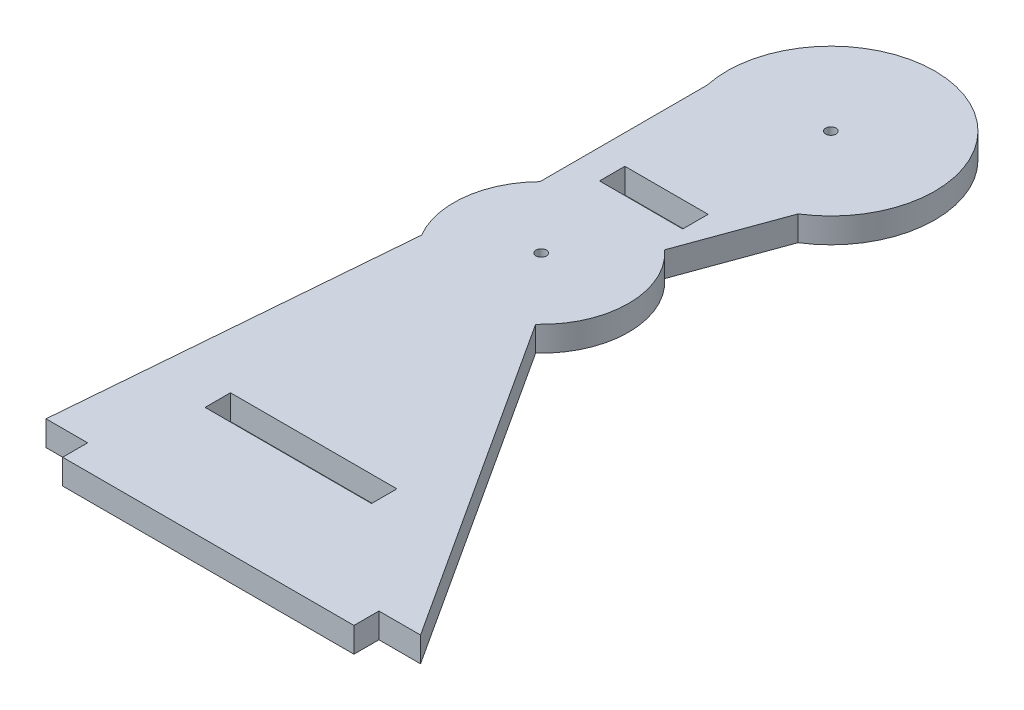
ISO-10303-21;
HEADER;
FILE_DESCRIPTION(('STEP AP214'),'2;1');
FILE_NAME('part.step','',(''),(''),'','','');
FILE_SCHEMA(('AUTOMOTIVE_DESIGN { 1 0 10303 214 1 1 1 1 }'));
ENDSEC;
DATA;
#1=APPLICATION_CONTEXT('core data for automotive mechanical design processes');
#2=APPLICATION_PROTOCOL_DEFINITION('international standard','automotive_design',2000,#1);
#3=PRODUCT_CONTEXT('',#1,'mechanical');
#4=PRODUCT('Part','Part','',(#3));
#5=PRODUCT_RELATED_PRODUCT_CATEGORY('part','',(#4));
#6=PRODUCT_DEFINITION_FORMATION('','',#4);
#7=PRODUCT_DEFINITION_CONTEXT('part definition',#1,'design');
#8=PRODUCT_DEFINITION('design','',#6,#7);
#9=PRODUCT_DEFINITION_SHAPE('','',#8);
#10=(LENGTH_UNIT() NAMED_UNIT(*) SI_UNIT(.MILLI.,.METRE.));
#11=(NAMED_UNIT(*) PLANE_ANGLE_UNIT() SI_UNIT($,.RADIAN.));
#12=(NAMED_UNIT(*) SI_UNIT($,.STERADIAN.) SOLID_ANGLE_UNIT());
#13=UNCERTAINTY_MEASURE_WITH_UNIT(LENGTH_MEASURE(1.E-05),#10,'distance_accuracy_value','');
#14=(GEOMETRIC_REPRESENTATION_CONTEXT(3) GLOBAL_UNCERTAINTY_ASSIGNED_CONTEXT((#13)) GLOBAL_UNIT_ASSIGNED_CONTEXT((#10,
#11,#12)) REPRESENTATION_CONTEXT('',''));
#15=CARTESIAN_POINT('',(0.,0.,0.));
#16=DIRECTION('',(0.,0.,1.));
#17=DIRECTION('',(1.,0.,0.));
#18=AXIS2_PLACEMENT_3D('',#15,#16,#17);
#19=CARTESIAN_POINT('',(-55.,6.,-100.));
#20=DIRECTION('',(0.,1.,0.));
#21=DIRECTION('',(0.,0.,1.));
#22=AXIS2_PLACEMENT_3D('',#19,#20,#21);
#23=PLANE('',#22);
#24=DIRECTION('',(1.,0.,0.));
#25=VECTOR('',#24,1.);
#26=CARTESIAN_POINT('',(-63.2592592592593,6.,-27.4814814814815));
#27=LINE('',#26,#25);
#28=CARTESIAN_POINT('',(-63.2592592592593,6.,-27.4814814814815));
#29=VERTEX_POINT('',#28);
#30=CARTESIAN_POINT('',(-23.2592592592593,6.,-27.4814814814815));
#31=VERTEX_POINT('',#30);
#32=EDGE_CURVE('E242',#29,#31,#27,.T.);
#33=ORIENTED_EDGE('',*,*,#32,.F.);
#34=DIRECTION('',(0.,0.,1.));
#35=VECTOR('',#34,1.);
#36=CARTESIAN_POINT('',(-63.2592592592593,6.,-33.5814814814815));
#37=LINE('',#36,#35);
#38=CARTESIAN_POINT('',(-63.2592592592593,6.,-33.5814814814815));
#39=VERTEX_POINT('',#38);
#40=EDGE_CURVE('E239',#39,#29,#37,.T.);
#41=ORIENTED_EDGE('',*,*,#40,.F.);
#42=DIRECTION('',(-1.,0.,0.));
#43=VECTOR('',#42,1.);
#44=CARTESIAN_POINT('',(-63.2592592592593,6.,-33.5814814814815));
#45=LINE('',#44,#43);
#46=CARTESIAN_POINT('',(-23.2592592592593,6.,-33.5814814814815));
#47=VERTEX_POINT('',#46);
#48=EDGE_CURVE('E250',#47,#39,#45,.T.);
#49=ORIENTED_EDGE('',*,*,#48,.F.);
#50=DIRECTION('',(0.,0.,-1.));
#51=VECTOR('',#50,1.);
#52=CARTESIAN_POINT('',(-23.2592592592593,6.,-33.5814814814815));
#53=LINE('',#52,#51);
#54=EDGE_CURVE('E246',#31,#47,#53,.T.);
#55=ORIENTED_EDGE('',*,*,#54,.F.);
#56=EDGE_LOOP('',(#33,#41,#49,#55));
#57=FACE_BOUND('',#56,.T.);
#58=CARTESIAN_POINT('',(-55.,6.,-100.));
#59=DIRECTION('',(0.,1.,0.));
#60=DIRECTION('',(0.,0.,1.));
#61=AXIS2_PLACEMENT_3D('',#58,#59,#60);
#62=CIRCLE('',#61,1.25);
#63=CARTESIAN_POINT('',(-55.,6.,-98.75));
#64=VERTEX_POINT('',#63);
#65=EDGE_CURVE('E282',#64,#64,#62,.T.);
#66=ORIENTED_EDGE('',*,*,#65,.F.);
#67=EDGE_LOOP('',(#66));
#68=FACE_BOUND('',#67,.T.);
#69=DIRECTION('',(1.,0.,0.));
#70=VECTOR('',#69,1.);
#71=CARTESIAN_POINT('',(-70.,6.,0.));
#72=LINE('',#71,#70);
#73=CARTESIAN_POINT('',(-70.,6.,0.));
#74=VERTEX_POINT('',#73);
#75=CARTESIAN_POINT('',(0.,6.,0.));
#76=VERTEX_POINT('',#75);
#77=EDGE_CURVE('E290',#74,#76,#72,.T.);
#78=ORIENTED_EDGE('',*,*,#77,.T.);
#79=DIRECTION('',(0.,0.,-1.));
#80=VECTOR('',#79,1.);
#81=CARTESIAN_POINT('',(0.,6.,0.));
#82=LINE('',#81,#80);
#83=CARTESIAN_POINT('',(0.,6.,-6.));
#84=VERTEX_POINT('',#83);
#85=EDGE_CURVE('E294',#76,#84,#82,.T.);
#86=ORIENTED_EDGE('',*,*,#85,.T.);
#87=DIRECTION('',(1.,0.,0.));
#88=VECTOR('',#87,1.);
#89=CARTESIAN_POINT('',(0.,6.,-6.));
#90=LINE('',#89,#88);
#91=CARTESIAN_POINT('',(10.,6.,-6.));
#92=VERTEX_POINT('',#91);
#93=EDGE_CURVE('E298',#84,#92,#90,.T.);
#94=ORIENTED_EDGE('',*,*,#93,.T.);
#95=DIRECTION('',(-0.543576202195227,0.,-0.83935982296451));
#96=VECTOR('',#95,1.);
#97=CARTESIAN_POINT('',(10.,6.,-6.));
#98=LINE('',#97,#96);
#99=CARTESIAN_POINT('',(-40.8350548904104,6.,-84.4966348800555));
#100=VERTEX_POINT('',#99);
#101=EDGE_CURVE('E301',#92,#100,#98,.T.);
#102=ORIENTED_EDGE('',*,*,#101,.T.);
#103=CARTESIAN_POINT('',(-55.,6.,-100.));
#104=DIRECTION('',(0.,1.,0.));
#105=DIRECTION('',(0.,0.,1.));
#106=AXIS2_PLACEMENT_3D('',#103,#104,#105);
#107=CIRCLE('',#106,21.);
#108=CARTESIAN_POINT('',(-40.8350548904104,6.,-115.503365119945));
#109=VERTEX_POINT('',#108);
#110=EDGE_CURVE('E304',#100,#109,#107,.T.);
#111=ORIENTED_EDGE('',*,*,#110,.T.);
#112=DIRECTION('',(0.342020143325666,0.,-0.93969262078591));
#113=VECTOR('',#112,1.);
#114=CARTESIAN_POINT('',(-40.8350548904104,6.,-115.503365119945));
#115=LINE('',#114,#113);
#116=CARTESIAN_POINT('',(-32.2845513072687,6.,-138.995680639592));
#117=VERTEX_POINT('',#116);
#118=EDGE_CURVE('E307',#109,#117,#115,.T.);
#119=ORIENTED_EDGE('',*,*,#118,.T.);
#120=CARTESIAN_POINT('',(-45.5718158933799,6.,-160.172285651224));
#121=DIRECTION('',(0.,1.,0.));
#122=DIRECTION('',(0.,0.,1.));
#123=AXIS2_PLACEMENT_3D('',#120,#121,#122);
#124=CIRCLE('',#123,25.);
#125=CARTESIAN_POINT('',(-70.,6.,-154.855912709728));
#126=VERTEX_POINT('',#125);
#127=EDGE_CURVE('E310',#117,#126,#124,.T.);
#128=ORIENTED_EDGE('',*,*,#127,.T.);
#129=DIRECTION('',(0.,0.,1.));
#130=VECTOR('',#129,1.);
#131=CARTESIAN_POINT('',(-70.,6.,-114.696938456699));
#132=LINE('',#131,#130);
#133=CARTESIAN_POINT('',(-70.,6.,-114.696938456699));
#134=VERTEX_POINT('',#133);
#135=EDGE_CURVE('E313',#126,#134,#132,.T.);
#136=ORIENTED_EDGE('',*,*,#135,.T.);
#137=CARTESIAN_POINT('',(-55.,6.,-100.));
#138=DIRECTION('',(0.,1.,0.));
#139=DIRECTION('',(0.,0.,1.));
#140=AXIS2_PLACEMENT_3D('',#137,#138,#139);
#141=CIRCLE('',#140,21.);
#142=CARTESIAN_POINT('',(-73.1006185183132,6.,-89.3525773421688));
#143=VERTEX_POINT('',#142);
#144=EDGE_CURVE('E316',#134,#143,#141,.T.);
#145=ORIENTED_EDGE('',*,*,#144,.T.);
#146=DIRECTION('',(-0.0824913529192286,0.,0.996591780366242));
#147=VECTOR('',#146,1.);
#148=CARTESIAN_POINT('',(-80.,6.,-6.));
#149=LINE('',#148,#147);
#150=CARTESIAN_POINT('',(-80.,6.,-6.));
#151=VERTEX_POINT('',#150);
#152=EDGE_CURVE('E319',#143,#151,#149,.T.);
#153=ORIENTED_EDGE('',*,*,#152,.T.);
#154=DIRECTION('',(1.,0.,0.));
#155=VECTOR('',#154,1.);
#156=CARTESIAN_POINT('',(-70.,6.,-6.));
#157=LINE('',#156,#155);
#158=CARTESIAN_POINT('',(-70.,6.,-6.));
#159=VERTEX_POINT('',#158);
#160=EDGE_CURVE('E322',#151,#159,#157,.T.);
#161=ORIENTED_EDGE('',*,*,#160,.T.);
#162=DIRECTION('',(0.,0.,1.));
#163=VECTOR('',#162,1.);
#164=CARTESIAN_POINT('',(-70.,6.,0.));
#165=LINE('',#164,#163);
#166=EDGE_CURVE('E325',#159,#74,#165,.T.);
#167=ORIENTED_EDGE('',*,*,#166,.T.);
#168=EDGE_LOOP('',(#78,#86,#94,#102,#111,#119,#128,#136,#145,#153,#161,#167));
#169=FACE_BOUND('',#168,.T.);
#170=CARTESIAN_POINT('',(-45.5718158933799,6.,-160.172285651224));
#171=DIRECTION('',(0.,1.,0.));
#172=DIRECTION('',(0.,0.,1.));
#173=AXIS2_PLACEMENT_3D('',#170,#171,#172);
#174=CIRCLE('',#173,1.25);
#175=CARTESIAN_POINT('',(-45.5718158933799,6.,-158.922285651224));
#176=VERTEX_POINT('',#175);
#177=EDGE_CURVE('E231',#176,#176,#174,.T.);
#178=ORIENTED_EDGE('',*,*,#177,.F.);
#179=EDGE_LOOP('',(#178));
#180=FACE_BOUND('',#179,.T.);
#181=DIRECTION('',(-1.,0.,0.));
#182=VECTOR('',#181,1.);
#183=CARTESIAN_POINT('',(-63.,6.,-128.1));
#184=LINE('',#183,#182);
#185=CARTESIAN_POINT('',(-43.,6.,-128.1));
#186=VERTEX_POINT('',#185);
#187=CARTESIAN_POINT('',(-63.,6.,-128.1));
#188=VERTEX_POINT('',#187);
#189=EDGE_CURVE('E192',#186,#188,#184,.T.);
#190=ORIENTED_EDGE('',*,*,#189,.F.);
#191=DIRECTION('',(0.,0.,-1.));
#192=VECTOR('',#191,1.);
#193=CARTESIAN_POINT('',(-43.,6.,-128.1));
#194=LINE('',#193,#192);
#195=CARTESIAN_POINT('',(-43.,6.,-122.));
#196=VERTEX_POINT('',#195);
#197=EDGE_CURVE('E183',#196,#186,#194,.T.);
#198=ORIENTED_EDGE('',*,*,#197,.F.);
#199=DIRECTION('',(1.,0.,0.));
#200=VECTOR('',#199,1.);
#201=CARTESIAN_POINT('',(-63.,6.,-122.));
#202=LINE('',#201,#200);
#203=CARTESIAN_POINT('',(-63.,6.,-122.));
#204=VERTEX_POINT('',#203);
#205=EDGE_CURVE('E209',#204,#196,#202,.T.);
#206=ORIENTED_EDGE('',*,*,#205,.F.);
#207=DIRECTION('',(0.,0.,1.));
#208=VECTOR('',#207,1.);
#209=CARTESIAN_POINT('',(-63.,6.,-128.1));
#210=LINE('',#209,#208);
#211=EDGE_CURVE('E205',#188,#204,#210,.T.);
#212=ORIENTED_EDGE('',*,*,#211,.F.);
#213=EDGE_LOOP('',(#190,#198,#206,#212));
#214=FACE_BOUND('',#213,.T.);
#215=ADVANCED_FACE('F45',(#57,#68,#169,#180,#214),#23,.T.);
#216=CARTESIAN_POINT('',(-55.,0.,-100.));
#217=DIRECTION('',(0.,1.,0.));
#218=DIRECTION('',(0.,0.,1.));
#219=AXIS2_PLACEMENT_3D('',#216,#217,#218);
#220=PLANE('',#219);
#221=CARTESIAN_POINT('',(-45.5718158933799,0.,-160.172285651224));
#222=DIRECTION('',(0.,1.,0.));
#223=DIRECTION('',(0.,0.,1.));
#224=AXIS2_PLACEMENT_3D('',#221,#222,#223);
#225=CIRCLE('',#224,1.25);
#226=CARTESIAN_POINT('',(-45.5718158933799,0.,-158.922285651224));
#227=VERTEX_POINT('',#226);
#228=EDGE_CURVE('E201',#227,#227,#225,.T.);
#229=ORIENTED_EDGE('',*,*,#228,.T.);
#230=EDGE_LOOP('',(#229));
#231=FACE_BOUND('',#230,.T.);
#232=DIRECTION('',(0.,0.,1.));
#233=VECTOR('',#232,1.);
#234=CARTESIAN_POINT('',(-63.2592592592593,0.,-33.5814814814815));
#235=LINE('',#234,#233);
#236=CARTESIAN_POINT('',(-63.2592592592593,0.,-33.5814814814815));
#237=VERTEX_POINT('',#236);
#238=CARTESIAN_POINT('',(-63.2592592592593,0.,-27.4814814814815));
#239=VERTEX_POINT('',#238);
#240=EDGE_CURVE('E235',#237,#239,#235,.T.);
#241=ORIENTED_EDGE('',*,*,#240,.T.);
#242=DIRECTION('',(1.,0.,0.));
#243=VECTOR('',#242,1.);
#244=CARTESIAN_POINT('',(-63.2592592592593,0.,-27.4814814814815));
#245=LINE('',#244,#243);
#246=CARTESIAN_POINT('',(-23.2592592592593,0.,-27.4814814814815));
#247=VERTEX_POINT('',#246);
#248=EDGE_CURVE('E257',#239,#247,#245,.T.);
#249=ORIENTED_EDGE('',*,*,#248,.T.);
#250=DIRECTION('',(0.,0.,-1.));
#251=VECTOR('',#250,1.);
#252=CARTESIAN_POINT('',(-23.2592592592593,0.,-33.5814814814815));
#253=LINE('',#252,#251);
#254=CARTESIAN_POINT('',(-23.2592592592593,0.,-33.5814814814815));
#255=VERTEX_POINT('',#254);
#256=EDGE_CURVE('E261',#247,#255,#253,.T.);
#257=ORIENTED_EDGE('',*,*,#256,.T.);
#258=DIRECTION('',(-1.,0.,0.));
#259=VECTOR('',#258,1.);
#260=CARTESIAN_POINT('',(-63.2592592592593,0.,-33.5814814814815));
#261=LINE('',#260,#259);
#262=EDGE_CURVE('E243',#255,#237,#261,.T.);
#263=ORIENTED_EDGE('',*,*,#262,.T.);
#264=EDGE_LOOP('',(#241,#249,#257,#263));
#265=FACE_BOUND('',#264,.T.);
#266=DIRECTION('',(1.,0.,0.));
#267=VECTOR('',#266,1.);
#268=CARTESIAN_POINT('',(-70.,0.,0.));
#269=LINE('',#268,#267);
#270=CARTESIAN_POINT('',(-70.,0.,0.));
#271=VERTEX_POINT('',#270);
#272=CARTESIAN_POINT('',(0.,0.,0.));
#273=VERTEX_POINT('',#272);
#274=EDGE_CURVE('E286',#271,#273,#269,.T.);
#275=ORIENTED_EDGE('',*,*,#274,.F.);
#276=DIRECTION('',(0.,0.,1.));
#277=VECTOR('',#276,1.);
#278=CARTESIAN_POINT('',(-70.,0.,0.));
#279=LINE('',#278,#277);
#280=CARTESIAN_POINT('',(-70.,0.,-6.));
#281=VERTEX_POINT('',#280);
#282=EDGE_CURVE('E295',#281,#271,#279,.T.);
#283=ORIENTED_EDGE('',*,*,#282,.F.);
#284=DIRECTION('',(1.,0.,0.));
#285=VECTOR('',#284,1.);
#286=CARTESIAN_POINT('',(-70.,0.,-6.));
#287=LINE('',#286,#285);
#288=CARTESIAN_POINT('',(-80.,0.,-6.));
#289=VERTEX_POINT('',#288);
#290=EDGE_CURVE('E359',#289,#281,#287,.T.);
#291=ORIENTED_EDGE('',*,*,#290,.F.);
#292=DIRECTION('',(-0.0824913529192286,0.,0.996591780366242));
#293=VECTOR('',#292,1.);
#294=CARTESIAN_POINT('',(-80.,0.,-6.));
#295=LINE('',#294,#293);
#296=CARTESIAN_POINT('',(-73.1006185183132,0.,-89.3525773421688));
#297=VERTEX_POINT('',#296);
#298=EDGE_CURVE('E356',#297,#289,#295,.T.);
#299=ORIENTED_EDGE('',*,*,#298,.F.);
#300=CARTESIAN_POINT('',(-55.,0.,-100.));
#301=DIRECTION('',(0.,1.,0.));
#302=DIRECTION('',(0.,0.,1.));
#303=AXIS2_PLACEMENT_3D('',#300,#301,#302);
#304=CIRCLE('',#303,21.);
#305=CARTESIAN_POINT('',(-70.,0.,-114.696938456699));
#306=VERTEX_POINT('',#305);
#307=EDGE_CURVE('E353',#306,#297,#304,.T.);
#308=ORIENTED_EDGE('',*,*,#307,.F.);
#309=DIRECTION('',(0.,0.,1.));
#310=VECTOR('',#309,1.);
#311=CARTESIAN_POINT('',(-70.,0.,-114.696938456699));
#312=LINE('',#311,#310);
#313=CARTESIAN_POINT('',(-70.,0.,-154.855912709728));
#314=VERTEX_POINT('',#313);
#315=EDGE_CURVE('E350',#314,#306,#312,.T.);
#316=ORIENTED_EDGE('',*,*,#315,.F.);
#317=CARTESIAN_POINT('',(-45.5718158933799,0.,-160.172285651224));
#318=DIRECTION('',(0.,1.,0.));
#319=DIRECTION('',(0.,0.,1.));
#320=AXIS2_PLACEMENT_3D('',#317,#318,#319);
#321=CIRCLE('',#320,25.);
#322=CARTESIAN_POINT('',(-32.2845513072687,0.,-138.995680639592));
#323=VERTEX_POINT('',#322);
#324=EDGE_CURVE('E347',#323,#314,#321,.T.);
#325=ORIENTED_EDGE('',*,*,#324,.F.);
#326=DIRECTION('',(0.342020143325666,0.,-0.93969262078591));
#327=VECTOR('',#326,1.);
#328=CARTESIAN_POINT('',(-40.8350548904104,0.,-115.503365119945));
#329=LINE('',#328,#327);
#330=CARTESIAN_POINT('',(-40.8350548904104,0.,-115.503365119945));
#331=VERTEX_POINT('',#330);
#332=EDGE_CURVE('E344',#331,#323,#329,.T.);
#333=ORIENTED_EDGE('',*,*,#332,.F.);
#334=CARTESIAN_POINT('',(-55.,0.,-100.));
#335=DIRECTION('',(0.,1.,0.));
#336=DIRECTION('',(0.,0.,1.));
#337=AXIS2_PLACEMENT_3D('',#334,#335,#336);
#338=CIRCLE('',#337,21.);
#339=CARTESIAN_POINT('',(-40.8350548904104,0.,-84.4966348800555));
#340=VERTEX_POINT('',#339);
#341=EDGE_CURVE('E341',#340,#331,#338,.T.);
#342=ORIENTED_EDGE('',*,*,#341,.F.);
#343=DIRECTION('',(-0.543576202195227,0.,-0.83935982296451));
#344=VECTOR('',#343,1.);
#345=CARTESIAN_POINT('',(10.,0.,-6.));
#346=LINE('',#345,#344);
#347=CARTESIAN_POINT('',(10.,0.,-6.));
#348=VERTEX_POINT('',#347);
#349=EDGE_CURVE('E338',#348,#340,#346,.T.);
#350=ORIENTED_EDGE('',*,*,#349,.F.);
#351=DIRECTION('',(1.,0.,0.));
#352=VECTOR('',#351,1.);
#353=CARTESIAN_POINT('',(0.,0.,-6.));
#354=LINE('',#353,#352);
#355=CARTESIAN_POINT('',(0.,0.,-6.));
#356=VERTEX_POINT('',#355);
#357=EDGE_CURVE('E335',#356,#348,#354,.T.);
#358=ORIENTED_EDGE('',*,*,#357,.F.);
#359=DIRECTION('',(0.,0.,-1.));
#360=VECTOR('',#359,1.);
#361=CARTESIAN_POINT('',(0.,0.,0.));
#362=LINE('',#361,#360);
#363=EDGE_CURVE('E332',#273,#356,#362,.T.);
#364=ORIENTED_EDGE('',*,*,#363,.F.);
#365=EDGE_LOOP('',(#275,#283,#291,#299,#308,#316,#325,#333,#342,#350,#358,#364));
#366=FACE_BOUND('',#365,.T.);
#367=CARTESIAN_POINT('',(-55.,0.,-100.));
#368=DIRECTION('',(0.,1.,0.));
#369=DIRECTION('',(0.,0.,1.));
#370=AXIS2_PLACEMENT_3D('',#367,#368,#369);
#371=CIRCLE('',#370,1.25);
#372=CARTESIAN_POINT('',(-55.,0.,-98.75));
#373=VERTEX_POINT('',#372);
#374=EDGE_CURVE('E281',#373,#373,#371,.T.);
#375=ORIENTED_EDGE('',*,*,#374,.T.);
#376=EDGE_LOOP('',(#375));
#377=FACE_BOUND('',#376,.T.);
#378=DIRECTION('',(0.,0.,-1.));
#379=VECTOR('',#378,1.);
#380=CARTESIAN_POINT('',(-43.,0.,-128.1));
#381=LINE('',#380,#379);
#382=CARTESIAN_POINT('',(-43.,0.,-122.));
#383=VERTEX_POINT('',#382);
#384=CARTESIAN_POINT('',(-43.,0.,-128.1));
#385=VERTEX_POINT('',#384);
#386=EDGE_CURVE('E69',#383,#385,#381,.T.);
#387=ORIENTED_EDGE('',*,*,#386,.T.);
#388=DIRECTION('',(-1.,0.,0.));
#389=VECTOR('',#388,1.);
#390=CARTESIAN_POINT('',(-63.,0.,-128.1));
#391=LINE('',#390,#389);
#392=CARTESIAN_POINT('',(-63.,0.,-128.1));
#393=VERTEX_POINT('',#392);
#394=EDGE_CURVE('E199',#385,#393,#391,.T.);
#395=ORIENTED_EDGE('',*,*,#394,.T.);
#396=DIRECTION('',(0.,0.,1.));
#397=VECTOR('',#396,1.);
#398=CARTESIAN_POINT('',(-63.,0.,-128.1));
#399=LINE('',#398,#397);
#400=CARTESIAN_POINT('',(-63.,0.,-122.));
#401=VERTEX_POINT('',#400);
#402=EDGE_CURVE('E218',#393,#401,#399,.T.);
#403=ORIENTED_EDGE('',*,*,#402,.T.);
#404=DIRECTION('',(1.,0.,0.));
#405=VECTOR('',#404,1.);
#406=CARTESIAN_POINT('',(-63.,0.,-122.));
#407=LINE('',#406,#405);
#408=EDGE_CURVE('E193',#401,#383,#407,.T.);
#409=ORIENTED_EDGE('',*,*,#408,.T.);
#410=EDGE_LOOP('',(#387,#395,#403,#409));
#411=FACE_BOUND('',#410,.T.);
#412=ADVANCED_FACE('F414',(#231,#265,#366,#377,#411),#220,.F.);
#413=CARTESIAN_POINT('',(-70.,6.,0.));
#414=DIRECTION('',(0.,0.,-1.));
#415=DIRECTION('',(-1.,0.,0.));
#416=AXIS2_PLACEMENT_3D('',#413,#414,#415);
#417=PLANE('',#416);
#418=ORIENTED_EDGE('',*,*,#274,.T.);
#419=DIRECTION('',(0.,-1.,0.));
#420=VECTOR('',#419,1.);
#421=CARTESIAN_POINT('',(0.,6.,0.));
#422=LINE('',#421,#420);
#423=EDGE_CURVE('E11',#76,#273,#422,.T.);
#424=ORIENTED_EDGE('',*,*,#423,.F.);
#425=ORIENTED_EDGE('',*,*,#77,.F.);
#426=DIRECTION('',(0.,-1.,0.));
#427=VECTOR('',#426,1.);
#428=CARTESIAN_POINT('',(-70.,6.,0.));
#429=LINE('',#428,#427);
#430=EDGE_CURVE('E328',#74,#271,#429,.T.);
#431=ORIENTED_EDGE('',*,*,#430,.T.);
#432=EDGE_LOOP('',(#418,#424,#425,#431));
#433=FACE_BOUND('',#432,.T.);
#434=ADVANCED_FACE('F47',(#433),#417,.F.);
#435=CARTESIAN_POINT('',(0.,6.,0.));
#436=DIRECTION('',(-1.,0.,0.));
#437=DIRECTION('',(0.,0.,1.));
#438=AXIS2_PLACEMENT_3D('',#435,#436,#437);
#439=PLANE('',#438);
#440=ORIENTED_EDGE('',*,*,#363,.T.);
#441=DIRECTION('',(0.,-1.,0.));
#442=VECTOR('',#441,1.);
#443=CARTESIAN_POINT('',(0.,6.,-6.));
#444=LINE('',#443,#442);
#445=EDGE_CURVE('E54',#84,#356,#444,.T.);
#446=ORIENTED_EDGE('',*,*,#445,.F.);
#447=ORIENTED_EDGE('',*,*,#85,.F.);
#448=ORIENTED_EDGE('',*,*,#423,.T.);
#449=EDGE_LOOP('',(#440,#446,#447,#448));
#450=FACE_BOUND('',#449,.T.);
#451=ADVANCED_FACE('F432',(#450),#439,.F.);
#452=CARTESIAN_POINT('',(0.,6.,-6.));
#453=DIRECTION('',(0.,0.,-1.));
#454=DIRECTION('',(-1.,0.,0.));
#455=AXIS2_PLACEMENT_3D('',#452,#453,#454);
#456=PLANE('',#455);
#457=ORIENTED_EDGE('',*,*,#357,.T.);
#458=DIRECTION('',(0.,-1.,0.));
#459=VECTOR('',#458,1.);
#460=CARTESIAN_POINT('',(10.,6.,-6.));
#461=LINE('',#460,#459);
#462=EDGE_CURVE('E399',#92,#348,#461,.T.);
#463=ORIENTED_EDGE('',*,*,#462,.F.);
#464=ORIENTED_EDGE('',*,*,#93,.F.);
#465=ORIENTED_EDGE('',*,*,#445,.T.);
#466=EDGE_LOOP('',(#457,#463,#464,#465));
#467=FACE_BOUND('',#466,.T.);
#468=ADVANCED_FACE('F408',(#467),#456,.F.);
#469=CARTESIAN_POINT('',(10.,6.,-6.));
#470=DIRECTION('',(-0.83935982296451,0.,0.543576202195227));
#471=DIRECTION('',(0.543576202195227,0.,0.83935982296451));
#472=AXIS2_PLACEMENT_3D('',#469,#470,#471);
#473=PLANE('',#472);
#474=ORIENTED_EDGE('',*,*,#349,.T.);
#475=DIRECTION('',(0.,-1.,0.));
#476=VECTOR('',#475,1.);
#477=CARTESIAN_POINT('',(-40.8350548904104,6.,-84.4966348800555));
#478=LINE('',#477,#476);
#479=EDGE_CURVE('E395',#100,#340,#478,.T.);
#480=ORIENTED_EDGE('',*,*,#479,.F.);
#481=ORIENTED_EDGE('',*,*,#101,.F.);
#482=ORIENTED_EDGE('',*,*,#462,.T.);
#483=EDGE_LOOP('',(#474,#480,#481,#482));
#484=FACE_BOUND('',#483,.T.);
#485=ADVANCED_FACE('F420',(#484),#473,.F.);
#486=CARTESIAN_POINT('',(-55.,6.,-100.));
#487=DIRECTION('',(0.,-1.,0.));
#488=DIRECTION('',(0.,0.,-1.));
#489=AXIS2_PLACEMENT_3D('',#486,#487,#488);
#490=CYLINDRICAL_SURFACE('',#489,21.);
#491=ORIENTED_EDGE('',*,*,#341,.T.);
#492=DIRECTION('',(0.,-1.,0.));
#493=VECTOR('',#492,1.);
#494=CARTESIAN_POINT('',(-40.8350548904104,6.,-115.503365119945));
#495=LINE('',#494,#493);
#496=EDGE_CURVE('E391',#109,#331,#495,.T.);
#497=ORIENTED_EDGE('',*,*,#496,.F.);
#498=ORIENTED_EDGE('',*,*,#110,.F.);
#499=ORIENTED_EDGE('',*,*,#479,.T.);
#500=EDGE_LOOP('',(#491,#497,#498,#499));
#501=FACE_BOUND('',#500,.T.);
#502=ADVANCED_FACE('F424',(#501),#490,.T.);
#503=CARTESIAN_POINT('',(-40.8350548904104,6.,-115.503365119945));
#504=DIRECTION('',(-0.939692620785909,0.,-0.342020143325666));
#505=DIRECTION('',(-0.342020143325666,0.,0.93969262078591));
#506=AXIS2_PLACEMENT_3D('',#503,#504,#505);
#507=PLANE('',#506);
#508=ORIENTED_EDGE('',*,*,#332,.T.);
#509=DIRECTION('',(0.,-1.,0.));
#510=VECTOR('',#509,1.);
#511=CARTESIAN_POINT('',(-32.2845513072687,6.,-138.995680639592));
#512=LINE('',#511,#510);
#513=EDGE_CURVE('E387',#117,#323,#512,.T.);
#514=ORIENTED_EDGE('',*,*,#513,.F.);
#515=ORIENTED_EDGE('',*,*,#118,.F.);
#516=ORIENTED_EDGE('',*,*,#496,.T.);
#517=EDGE_LOOP('',(#508,#514,#515,#516));
#518=FACE_BOUND('',#517,.T.);
#519=ADVANCED_FACE('F465',(#518),#507,.F.);
#520=CARTESIAN_POINT('',(-45.5718158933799,6.,-160.172285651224));
#521=DIRECTION('',(0.,-1.,0.));
#522=DIRECTION('',(0.,0.,-1.));
#523=AXIS2_PLACEMENT_3D('',#520,#521,#522);
#524=CYLINDRICAL_SURFACE('',#523,25.);
#525=ORIENTED_EDGE('',*,*,#324,.T.);
#526=DIRECTION('',(0.,-1.,0.));
#527=VECTOR('',#526,1.);
#528=CARTESIAN_POINT('',(-70.,6.,-154.855912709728));
#529=LINE('',#528,#527);
#530=EDGE_CURVE('E383',#126,#314,#529,.T.);
#531=ORIENTED_EDGE('',*,*,#530,.F.);
#532=ORIENTED_EDGE('',*,*,#127,.F.);
#533=ORIENTED_EDGE('',*,*,#513,.T.);
#534=EDGE_LOOP('',(#525,#531,#532,#533));
#535=FACE_BOUND('',#534,.T.);
#536=ADVANCED_FACE('F463',(#535),#524,.T.);
#537=CARTESIAN_POINT('',(-70.,6.,-114.696938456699));
#538=DIRECTION('',(1.,0.,0.));
#539=DIRECTION('',(0.,0.,-1.));
#540=AXIS2_PLACEMENT_3D('',#537,#538,#539);
#541=PLANE('',#540);
#542=ORIENTED_EDGE('',*,*,#315,.T.);
#543=DIRECTION('',(0.,-1.,0.));
#544=VECTOR('',#543,1.);
#545=CARTESIAN_POINT('',(-70.,6.,-114.696938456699));
#546=LINE('',#545,#544);
#547=EDGE_CURVE('E379',#134,#306,#546,.T.);
#548=ORIENTED_EDGE('',*,*,#547,.F.);
#549=ORIENTED_EDGE('',*,*,#135,.F.);
#550=ORIENTED_EDGE('',*,*,#530,.T.);
#551=EDGE_LOOP('',(#542,#548,#549,#550));
#552=FACE_BOUND('',#551,.T.);
#553=ADVANCED_FACE('F459',(#552),#541,.F.);
#554=CARTESIAN_POINT('',(-55.,6.,-100.));
#555=DIRECTION('',(0.,-1.,0.));
#556=DIRECTION('',(0.,0.,-1.));
#557=AXIS2_PLACEMENT_3D('',#554,#555,#556);
#558=CYLINDRICAL_SURFACE('',#557,21.);
#559=ORIENTED_EDGE('',*,*,#307,.T.);
#560=DIRECTION('',(0.,-1.,0.));
#561=VECTOR('',#560,1.);
#562=CARTESIAN_POINT('',(-73.1006185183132,6.,-89.3525773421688));
#563=LINE('',#562,#561);
#564=EDGE_CURVE('E375',#143,#297,#563,.T.);
#565=ORIENTED_EDGE('',*,*,#564,.F.);
#566=ORIENTED_EDGE('',*,*,#144,.F.);
#567=ORIENTED_EDGE('',*,*,#547,.T.);
#568=EDGE_LOOP('',(#559,#565,#566,#567));
#569=FACE_BOUND('',#568,.T.);
#570=ADVANCED_FACE('F454',(#569),#558,.T.);
#571=CARTESIAN_POINT('',(-80.,6.,-6.));
#572=DIRECTION('',(0.996591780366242,0.,0.0824913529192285));
#573=DIRECTION('',(0.0824913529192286,0.,-0.996591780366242));
#574=AXIS2_PLACEMENT_3D('',#571,#572,#573);
#575=PLANE('',#574);
#576=ORIENTED_EDGE('',*,*,#298,.T.);
#577=DIRECTION('',(0.,-1.,0.));
#578=VECTOR('',#577,1.);
#579=CARTESIAN_POINT('',(-80.,6.,-6.));
#580=LINE('',#579,#578);
#581=EDGE_CURVE('E371',#151,#289,#580,.T.);
#582=ORIENTED_EDGE('',*,*,#581,.F.);
#583=ORIENTED_EDGE('',*,*,#152,.F.);
#584=ORIENTED_EDGE('',*,*,#564,.T.);
#585=EDGE_LOOP('',(#576,#582,#583,#584));
#586=FACE_BOUND('',#585,.T.);
#587=ADVANCED_FACE('F448',(#586),#575,.F.);
#588=CARTESIAN_POINT('',(-70.,6.,-6.));
#589=DIRECTION('',(0.,0.,-1.));
#590=DIRECTION('',(-1.,0.,0.));
#591=AXIS2_PLACEMENT_3D('',#588,#589,#590);
#592=PLANE('',#591);
#593=ORIENTED_EDGE('',*,*,#290,.T.);
#594=DIRECTION('',(0.,-1.,0.));
#595=VECTOR('',#594,1.);
#596=CARTESIAN_POINT('',(-70.,6.,-6.));
#597=LINE('',#596,#595);
#598=EDGE_CURVE('E367',#159,#281,#597,.T.);
#599=ORIENTED_EDGE('',*,*,#598,.F.);
#600=ORIENTED_EDGE('',*,*,#160,.F.);
#601=ORIENTED_EDGE('',*,*,#581,.T.);
#602=EDGE_LOOP('',(#593,#599,#600,#601));
#603=FACE_BOUND('',#602,.T.);
#604=ADVANCED_FACE('F444',(#603),#592,.F.);
#605=CARTESIAN_POINT('',(-70.,6.,0.));
#606=DIRECTION('',(1.,0.,0.));
#607=DIRECTION('',(0.,0.,-1.));
#608=AXIS2_PLACEMENT_3D('',#605,#606,#607);
#609=PLANE('',#608);
#610=ORIENTED_EDGE('',*,*,#282,.T.);
#611=ORIENTED_EDGE('',*,*,#430,.F.);
#612=ORIENTED_EDGE('',*,*,#166,.F.);
#613=ORIENTED_EDGE('',*,*,#598,.T.);
#614=EDGE_LOOP('',(#610,#611,#612,#613));
#615=FACE_BOUND('',#614,.T.);
#616=ADVANCED_FACE('F439',(#615),#609,.F.);
#617=CARTESIAN_POINT('',(-55.,6.,-100.));
#618=DIRECTION('',(0.,-1.,0.));
#619=DIRECTION('',(0.,0.,-1.));
#620=AXIS2_PLACEMENT_3D('',#617,#618,#619);
#621=CYLINDRICAL_SURFACE('',#620,1.25);
#622=ORIENTED_EDGE('',*,*,#65,.T.);
#623=EDGE_LOOP('',(#622));
#624=FACE_BOUND('',#623,.T.);
#625=ORIENTED_EDGE('',*,*,#374,.F.);
#626=EDGE_LOOP('',(#625));
#627=FACE_BOUND('',#626,.T.);
#628=ADVANCED_FACE('F485',(#624,#627),#621,.F.);
#629=CARTESIAN_POINT('',(-63.2592592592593,6.,-33.5814814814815));
#630=DIRECTION('',(1.,0.,0.));
#631=DIRECTION('',(0.,0.,-1.));
#632=AXIS2_PLACEMENT_3D('',#629,#630,#631);
#633=PLANE('',#632);
#634=ORIENTED_EDGE('',*,*,#240,.F.);
#635=DIRECTION('',(0.,-1.,0.));
#636=VECTOR('',#635,1.);
#637=CARTESIAN_POINT('',(-63.2592592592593,6.,-33.5814814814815));
#638=LINE('',#637,#636);
#639=EDGE_CURVE('E253',#39,#237,#638,.T.);
#640=ORIENTED_EDGE('',*,*,#639,.F.);
#641=ORIENTED_EDGE('',*,*,#40,.T.);
#642=DIRECTION('',(0.,-1.,0.));
#643=VECTOR('',#642,1.);
#644=CARTESIAN_POINT('',(-63.2592592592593,6.,-27.4814814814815));
#645=LINE('',#644,#643);
#646=EDGE_CURVE('E277',#29,#239,#645,.T.);
#647=ORIENTED_EDGE('',*,*,#646,.T.);
#648=EDGE_LOOP('',(#634,#640,#641,#647));
#649=FACE_BOUND('',#648,.T.);
#650=ADVANCED_FACE('F528',(#649),#633,.T.);
#651=CARTESIAN_POINT('',(-63.2592592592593,6.,-27.4814814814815));
#652=DIRECTION('',(0.,0.,-1.));
#653=DIRECTION('',(-1.,0.,0.));
#654=AXIS2_PLACEMENT_3D('',#651,#652,#653);
#655=PLANE('',#654);
#656=ORIENTED_EDGE('',*,*,#248,.F.);
#657=ORIENTED_EDGE('',*,*,#646,.F.);
#658=ORIENTED_EDGE('',*,*,#32,.T.);
#659=DIRECTION('',(0.,-1.,0.));
#660=VECTOR('',#659,1.);
#661=CARTESIAN_POINT('',(-23.2592592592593,6.,-27.4814814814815));
#662=LINE('',#661,#660);
#663=EDGE_CURVE('E274',#31,#247,#662,.T.);
#664=ORIENTED_EDGE('',*,*,#663,.T.);
#665=EDGE_LOOP('',(#656,#657,#658,#664));
#666=FACE_BOUND('',#665,.T.);
#667=ADVANCED_FACE('F536',(#666),#655,.T.);
#668=CARTESIAN_POINT('',(-23.2592592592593,6.,-33.5814814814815));
#669=DIRECTION('',(-1.,0.,0.));
#670=DIRECTION('',(0.,0.,1.));
#671=AXIS2_PLACEMENT_3D('',#668,#669,#670);
#672=PLANE('',#671);
#673=ORIENTED_EDGE('',*,*,#256,.F.);
#674=ORIENTED_EDGE('',*,*,#663,.F.);
#675=ORIENTED_EDGE('',*,*,#54,.T.);
#676=DIRECTION('',(0.,-1.,0.));
#677=VECTOR('',#676,1.);
#678=CARTESIAN_POINT('',(-23.2592592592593,6.,-33.5814814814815));
#679=LINE('',#678,#677);
#680=EDGE_CURVE('E271',#47,#255,#679,.T.);
#681=ORIENTED_EDGE('',*,*,#680,.T.);
#682=EDGE_LOOP('',(#673,#674,#675,#681));
#683=FACE_BOUND('',#682,.T.);
#684=ADVANCED_FACE('F544',(#683),#672,.T.);
#685=CARTESIAN_POINT('',(-63.2592592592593,6.,-33.5814814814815));
#686=DIRECTION('',(0.,0.,1.));
#687=DIRECTION('',(1.,0.,0.));
#688=AXIS2_PLACEMENT_3D('',#685,#686,#687);
#689=PLANE('',#688);
#690=ORIENTED_EDGE('',*,*,#262,.F.);
#691=ORIENTED_EDGE('',*,*,#680,.F.);
#692=ORIENTED_EDGE('',*,*,#48,.T.);
#693=ORIENTED_EDGE('',*,*,#639,.T.);
#694=EDGE_LOOP('',(#690,#691,#692,#693));
#695=FACE_BOUND('',#694,.T.);
#696=ADVANCED_FACE('F553',(#695),#689,.T.);
#697=CARTESIAN_POINT('',(-45.5718158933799,6.,-160.172285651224));
#698=DIRECTION('',(0.,-1.,0.));
#699=DIRECTION('',(0.,0.,-1.));
#700=AXIS2_PLACEMENT_3D('',#697,#698,#699);
#701=CYLINDRICAL_SURFACE('',#700,1.25);
#702=ORIENTED_EDGE('',*,*,#177,.T.);
#703=EDGE_LOOP('',(#702));
#704=FACE_BOUND('',#703,.T.);
#705=ORIENTED_EDGE('',*,*,#228,.F.);
#706=EDGE_LOOP('',(#705));
#707=FACE_BOUND('',#706,.T.);
#708=ADVANCED_FACE('F562',(#704,#707),#701,.F.);
#709=CARTESIAN_POINT('',(-43.,6.,-128.1));
#710=DIRECTION('',(-1.,0.,0.));
#711=DIRECTION('',(0.,0.,1.));
#712=AXIS2_PLACEMENT_3D('',#709,#710,#711);
#713=PLANE('',#712);
#714=ORIENTED_EDGE('',*,*,#386,.F.);
#715=DIRECTION('',(0.,-1.,0.));
#716=VECTOR('',#715,1.);
#717=CARTESIAN_POINT('',(-43.,6.,-122.));
#718=LINE('',#717,#716);
#719=EDGE_CURVE('E187',#196,#383,#718,.T.);
#720=ORIENTED_EDGE('',*,*,#719,.F.);
#721=ORIENTED_EDGE('',*,*,#197,.T.);
#722=DIRECTION('',(0.,-1.,0.));
#723=VECTOR('',#722,1.);
#724=CARTESIAN_POINT('',(-43.,6.,-128.1));
#725=LINE('',#724,#723);
#726=EDGE_CURVE('E186',#186,#385,#725,.T.);
#727=ORIENTED_EDGE('',*,*,#726,.T.);
#728=EDGE_LOOP('',(#714,#720,#721,#727));
#729=FACE_BOUND('',#728,.T.);
#730=ADVANCED_FACE('F185',(#729),#713,.T.);
#731=CARTESIAN_POINT('',(-63.,6.,-128.1));
#732=DIRECTION('',(0.,0.,1.));
#733=DIRECTION('',(1.,0.,0.));
#734=AXIS2_PLACEMENT_3D('',#731,#732,#733);
#735=PLANE('',#734);
#736=ORIENTED_EDGE('',*,*,#394,.F.);
#737=ORIENTED_EDGE('',*,*,#726,.F.);
#738=ORIENTED_EDGE('',*,*,#189,.T.);
#739=DIRECTION('',(0.,-1.,0.));
#740=VECTOR('',#739,1.);
#741=CARTESIAN_POINT('',(-63.,6.,-128.1));
#742=LINE('',#741,#740);
#743=EDGE_CURVE('E202',#188,#393,#742,.T.);
#744=ORIENTED_EDGE('',*,*,#743,.T.);
#745=EDGE_LOOP('',(#736,#737,#738,#744));
#746=FACE_BOUND('',#745,.T.);
#747=ADVANCED_FACE('F196',(#746),#735,.T.);
#748=CARTESIAN_POINT('',(-63.,6.,-128.1));
#749=DIRECTION('',(1.,0.,0.));
#750=DIRECTION('',(0.,0.,-1.));
#751=AXIS2_PLACEMENT_3D('',#748,#749,#750);
#752=PLANE('',#751);
#753=ORIENTED_EDGE('',*,*,#402,.F.);
#754=ORIENTED_EDGE('',*,*,#743,.F.);
#755=ORIENTED_EDGE('',*,*,#211,.T.);
#756=DIRECTION('',(0.,-1.,0.));
#757=VECTOR('',#756,1.);
#758=CARTESIAN_POINT('',(-63.,6.,-122.));
#759=LINE('',#758,#757);
#760=EDGE_CURVE('E61',#204,#401,#759,.T.);
#761=ORIENTED_EDGE('',*,*,#760,.T.);
#762=EDGE_LOOP('',(#753,#754,#755,#761));
#763=FACE_BOUND('',#762,.T.);
#764=ADVANCED_FACE('F586',(#763),#752,.T.);
#765=CARTESIAN_POINT('',(-63.,6.,-122.));
#766=DIRECTION('',(0.,0.,-1.));
#767=DIRECTION('',(-1.,0.,0.));
#768=AXIS2_PLACEMENT_3D('',#765,#766,#767);
#769=PLANE('',#768);
#770=ORIENTED_EDGE('',*,*,#408,.F.);
#771=ORIENTED_EDGE('',*,*,#760,.F.);
#772=ORIENTED_EDGE('',*,*,#205,.T.);
#773=ORIENTED_EDGE('',*,*,#719,.T.);
#774=EDGE_LOOP('',(#770,#771,#772,#773));
#775=FACE_BOUND('',#774,.T.);
#776=ADVANCED_FACE('F594',(#775),#769,.T.);
#777=CLOSED_SHELL('',(#215,#412,#434,#451,#468,#485,#502,#519,#536,#553,#570,#587,#604,#616,
#628,#650,#667,#684,#696,#708,#730,#747,#764,#776));
#778=MANIFOLD_SOLID_BREP('B2',#777);
#779=ADVANCED_BREP_SHAPE_REPRESENTATION('',(#18,#778),#14);
#780=SHAPE_DEFINITION_REPRESENTATION(#9,#779);
ENDSEC;
END-ISO-10303-21;
